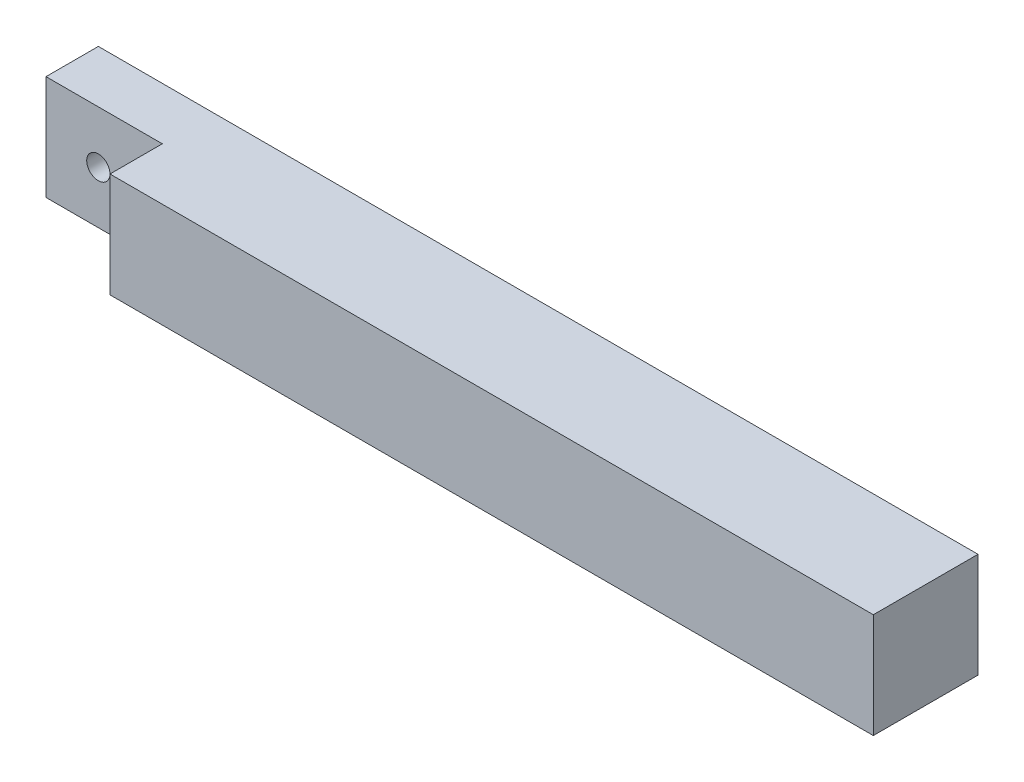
from build123d import *

# Parameters (mm, degrees)
ESQUISSE1_W             = 75.63
ESQUISSE1_H             = 9
EXTRUSION1_DEPTH        = 9
ESQUISSE2_W             = 10
ESQUISSE2_H             = 9
ENL_V_MAT_EXTRU_1_DEPTH = 4.5
ESQUISSE3_R             = 1
ENL_V_MAT_EXTRU_2_DEPTH = 4.5


with BuildPart() as part:
    # Esquisse1 → Extrusion1 (new body)
    with BuildSketch(Plane.XY):
        with Locations((37.815, 4.5)):
            Rectangle(ESQUISSE1_W, ESQUISSE1_H)
    extrude(amount=EXTRUSION1_DEPTH)

    # Esquisse2 → Enl_v. mat.-Extru.1 (cut)
    with BuildSketch(Plane.XY.offset(9)):
        with Locations((5, 4.5)):
            Rectangle(ESQUISSE2_W, ESQUISSE2_H)
    extrude(amount=-ENL_V_MAT_EXTRU_1_DEPTH, mode=Mode.SUBTRACT)

    # Esquisse3 → Enl_v. mat.-Extru.2 (cut)
    with BuildSketch(Plane.XY.offset(4.5)):
        with Locations((4.5, 4.5)):
            Circle(ESQUISSE3_R)
    extrude(amount=-ENL_V_MAT_EXTRU_2_DEPTH, mode=Mode.SUBTRACT)


solid = part.part
